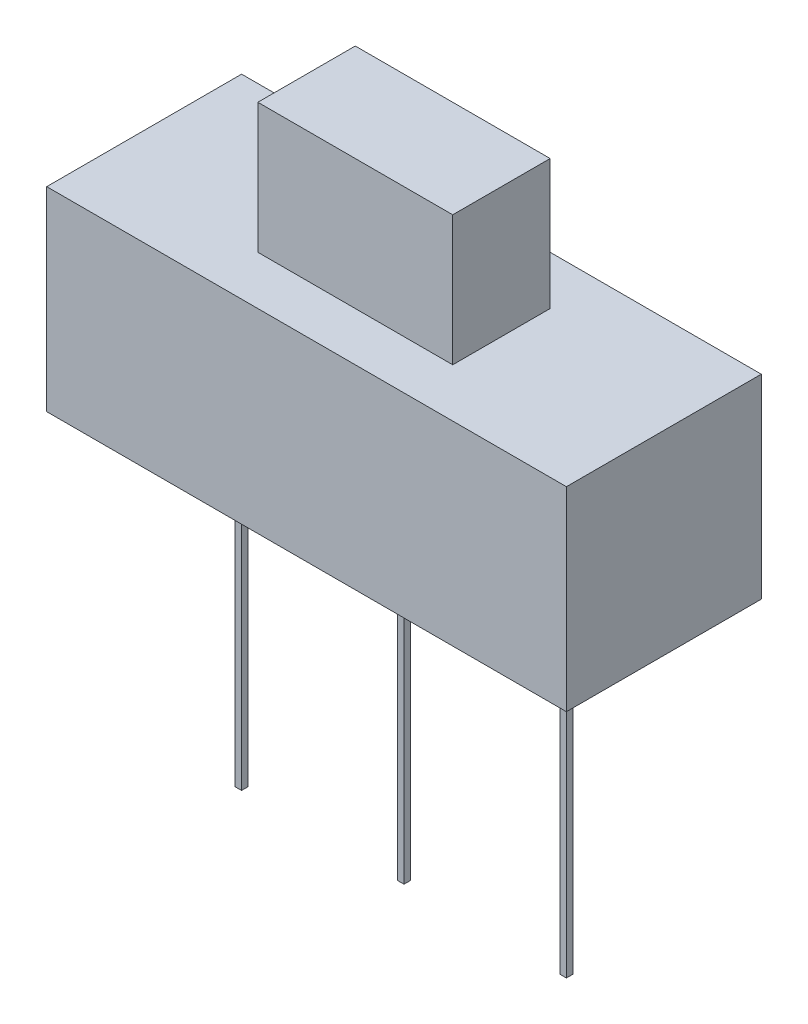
ISO-10303-21;
HEADER;
FILE_DESCRIPTION(('STEP AP214'),'2;1');
FILE_NAME('part.step','',(''),(''),'','','');
FILE_SCHEMA(('AUTOMOTIVE_DESIGN { 1 0 10303 214 1 1 1 1 }'));
ENDSEC;
DATA;
#1=APPLICATION_CONTEXT('core data for automotive mechanical design processes');
#2=APPLICATION_PROTOCOL_DEFINITION('international standard','automotive_design',2000,#1);
#3=PRODUCT_CONTEXT('',#1,'mechanical');
#4=PRODUCT('Part','Part','',(#3));
#5=PRODUCT_RELATED_PRODUCT_CATEGORY('part','',(#4));
#6=PRODUCT_DEFINITION_FORMATION('','',#4);
#7=PRODUCT_DEFINITION_CONTEXT('part definition',#1,'design');
#8=PRODUCT_DEFINITION('design','',#6,#7);
#9=PRODUCT_DEFINITION_SHAPE('','',#8);
#10=(LENGTH_UNIT() NAMED_UNIT(*) SI_UNIT(.MILLI.,.METRE.));
#11=(NAMED_UNIT(*) PLANE_ANGLE_UNIT() SI_UNIT($,.RADIAN.));
#12=(NAMED_UNIT(*) SI_UNIT($,.STERADIAN.) SOLID_ANGLE_UNIT());
#13=UNCERTAINTY_MEASURE_WITH_UNIT(LENGTH_MEASURE(1.E-05),#10,'distance_accuracy_value','');
#14=(GEOMETRIC_REPRESENTATION_CONTEXT(3) GLOBAL_UNCERTAINTY_ASSIGNED_CONTEXT((#13)) GLOBAL_UNIT_ASSIGNED_CONTEXT((#10,
#11,#12)) REPRESENTATION_CONTEXT('',''));
#15=CARTESIAN_POINT('',(0.,0.,0.));
#16=DIRECTION('',(0.,0.,1.));
#17=DIRECTION('',(1.,0.,0.));
#18=AXIS2_PLACEMENT_3D('',#15,#16,#17);
#19=CARTESIAN_POINT('',(0.,0.,0.));
#20=DIRECTION('',(0.,-1.,0.));
#21=DIRECTION('',(0.,0.,-1.));
#22=AXIS2_PLACEMENT_3D('',#19,#20,#21);
#23=PLANE('',#22);
#24=DIRECTION('',(1.,0.,0.));
#25=VECTOR('',#24,1.);
#26=CARTESIAN_POINT('',(0.,0.,0.0499999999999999));
#27=LINE('',#26,#25);
#28=CARTESIAN_POINT('',(-2.55,0.,0.0499999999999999));
#29=VERTEX_POINT('',#28);
#30=CARTESIAN_POINT('',(-2.45,0.,0.0499999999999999));
#31=VERTEX_POINT('',#30);
#32=EDGE_CURVE('E178',#29,#31,#27,.T.);
#33=ORIENTED_EDGE('',*,*,#32,.T.);
#34=DIRECTION('',(0.,0.,1.));
#35=VECTOR('',#34,1.);
#36=CARTESIAN_POINT('',(-2.45,0.,0.));
#37=LINE('',#36,#35);
#38=CARTESIAN_POINT('',(-2.45,0.,-0.0500000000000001));
#39=VERTEX_POINT('',#38);
#40=EDGE_CURVE('E192',#39,#31,#37,.T.);
#41=ORIENTED_EDGE('',*,*,#40,.F.);
#42=DIRECTION('',(1.,0.,0.));
#43=VECTOR('',#42,1.);
#44=CARTESIAN_POINT('',(0.,0.,-0.0500000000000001));
#45=LINE('',#44,#43);
#46=CARTESIAN_POINT('',(-2.55,0.,-0.0500000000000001));
#47=VERTEX_POINT('',#46);
#48=EDGE_CURVE('E205',#47,#39,#45,.T.);
#49=ORIENTED_EDGE('',*,*,#48,.F.);
#50=DIRECTION('',(0.,0.,1.));
#51=VECTOR('',#50,1.);
#52=CARTESIAN_POINT('',(-2.55,0.,0.));
#53=LINE('',#52,#51);
#54=EDGE_CURVE('E203',#47,#29,#53,.T.);
#55=ORIENTED_EDGE('',*,*,#54,.T.);
#56=EDGE_LOOP('',(#33,#41,#49,#55));
#57=FACE_BOUND('',#56,.T.);
#58=DIRECTION('',(1.,0.,0.));
#59=VECTOR('',#58,1.);
#60=CARTESIAN_POINT('',(0.,0.,0.0499999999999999));
#61=LINE('',#60,#59);
#62=CARTESIAN_POINT('',(2.45,0.,0.0499999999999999));
#63=VERTEX_POINT('',#62);
#64=CARTESIAN_POINT('',(2.55,0.,0.0499999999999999));
#65=VERTEX_POINT('',#64);
#66=EDGE_CURVE('E240',#63,#65,#61,.T.);
#67=ORIENTED_EDGE('',*,*,#66,.T.);
#68=DIRECTION('',(0.,0.,1.));
#69=VECTOR('',#68,1.);
#70=CARTESIAN_POINT('',(2.55,0.,0.));
#71=LINE('',#70,#69);
#72=CARTESIAN_POINT('',(2.55,0.,-0.0500000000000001));
#73=VERTEX_POINT('',#72);
#74=EDGE_CURVE('E245',#73,#65,#71,.T.);
#75=ORIENTED_EDGE('',*,*,#74,.F.);
#76=DIRECTION('',(1.,0.,0.));
#77=VECTOR('',#76,1.);
#78=CARTESIAN_POINT('',(0.,0.,-0.0500000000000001));
#79=LINE('',#78,#77);
#80=CARTESIAN_POINT('',(2.45,0.,-0.0500000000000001));
#81=VERTEX_POINT('',#80);
#82=EDGE_CURVE('E258',#81,#73,#79,.T.);
#83=ORIENTED_EDGE('',*,*,#82,.F.);
#84=DIRECTION('',(0.,0.,1.));
#85=VECTOR('',#84,1.);
#86=CARTESIAN_POINT('',(2.45,0.,0.));
#87=LINE('',#86,#85);
#88=EDGE_CURVE('E255',#81,#63,#87,.T.);
#89=ORIENTED_EDGE('',*,*,#88,.T.);
#90=EDGE_LOOP('',(#67,#75,#83,#89));
#91=FACE_BOUND('',#90,.T.);
#92=DIRECTION('',(0.,0.,-1.));
#93=VECTOR('',#92,1.);
#94=CARTESIAN_POINT('',(4.,0.,1.5));
#95=LINE('',#94,#93);
#96=CARTESIAN_POINT('',(4.,0.,1.5));
#97=VERTEX_POINT('',#96);
#98=CARTESIAN_POINT('',(4.,0.,-1.5));
#99=VERTEX_POINT('',#98);
#100=EDGE_CURVE('E303',#97,#99,#95,.T.);
#101=ORIENTED_EDGE('',*,*,#100,.F.);
#102=DIRECTION('',(1.,0.,0.));
#103=VECTOR('',#102,1.);
#104=CARTESIAN_POINT('',(-4.,0.,1.5));
#105=LINE('',#104,#103);
#106=CARTESIAN_POINT('',(-4.,0.,1.5));
#107=VERTEX_POINT('',#106);
#108=EDGE_CURVE('E308',#107,#97,#105,.T.);
#109=ORIENTED_EDGE('',*,*,#108,.F.);
#110=DIRECTION('',(0.,0.,1.));
#111=VECTOR('',#110,1.);
#112=CARTESIAN_POINT('',(-4.,0.,1.5));
#113=LINE('',#112,#111);
#114=CARTESIAN_POINT('',(-4.,0.,-1.5));
#115=VERTEX_POINT('',#114);
#116=EDGE_CURVE('E319',#115,#107,#113,.T.);
#117=ORIENTED_EDGE('',*,*,#116,.F.);
#118=DIRECTION('',(-1.,0.,0.));
#119=VECTOR('',#118,1.);
#120=CARTESIAN_POINT('',(-4.,0.,-1.5));
#121=LINE('',#120,#119);
#122=EDGE_CURVE('E317',#99,#115,#121,.T.);
#123=ORIENTED_EDGE('',*,*,#122,.F.);
#124=EDGE_LOOP('',(#101,#109,#117,#123));
#125=FACE_BOUND('',#124,.T.);
#126=DIRECTION('',(0.,0.,1.));
#127=VECTOR('',#126,1.);
#128=CARTESIAN_POINT('',(0.05,0.,0.));
#129=LINE('',#128,#127);
#130=CARTESIAN_POINT('',(0.05,0.,-0.0500000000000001));
#131=VERTEX_POINT('',#130);
#132=CARTESIAN_POINT('',(0.05,0.,0.0499999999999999));
#133=VERTEX_POINT('',#132);
#134=EDGE_CURVE('E57',#131,#133,#129,.T.);
#135=ORIENTED_EDGE('',*,*,#134,.F.);
#136=DIRECTION('',(1.,0.,0.));
#137=VECTOR('',#136,1.);
#138=CARTESIAN_POINT('',(0.,0.,-0.0500000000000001));
#139=LINE('',#138,#137);
#140=CARTESIAN_POINT('',(-0.05,0.,-0.0500000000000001));
#141=VERTEX_POINT('',#140);
#142=EDGE_CURVE('E183',#141,#131,#139,.T.);
#143=ORIENTED_EDGE('',*,*,#142,.F.);
#144=DIRECTION('',(0.,0.,1.));
#145=VECTOR('',#144,1.);
#146=CARTESIAN_POINT('',(-0.05,0.,0.));
#147=LINE('',#146,#145);
#148=CARTESIAN_POINT('',(-0.05,0.,0.0499999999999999));
#149=VERTEX_POINT('',#148);
#150=EDGE_CURVE('E215',#141,#149,#147,.T.);
#151=ORIENTED_EDGE('',*,*,#150,.T.);
#152=DIRECTION('',(1.,0.,0.));
#153=VECTOR('',#152,1.);
#154=CARTESIAN_POINT('',(0.,0.,0.0499999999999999));
#155=LINE('',#154,#153);
#156=EDGE_CURVE('E227',#149,#133,#155,.T.);
#157=ORIENTED_EDGE('',*,*,#156,.T.);
#158=EDGE_LOOP('',(#135,#143,#151,#157));
#159=FACE_BOUND('',#158,.T.);
#160=ADVANCED_FACE('F34',(#57,#91,#125,#159),#23,.T.);
#161=CARTESIAN_POINT('',(0.,3.,0.));
#162=DIRECTION('',(0.,-1.,0.));
#163=DIRECTION('',(0.,0.,-1.));
#164=AXIS2_PLACEMENT_3D('',#161,#162,#163);
#165=PLANE('',#164);
#166=DIRECTION('',(0.,0.,-1.));
#167=VECTOR('',#166,1.);
#168=CARTESIAN_POINT('',(4.,3.,1.5));
#169=LINE('',#168,#167);
#170=CARTESIAN_POINT('',(4.,3.,1.5));
#171=VERTEX_POINT('',#170);
#172=CARTESIAN_POINT('',(4.,3.,-1.5));
#173=VERTEX_POINT('',#172);
#174=EDGE_CURVE('E304',#171,#173,#169,.T.);
#175=ORIENTED_EDGE('',*,*,#174,.T.);
#176=DIRECTION('',(-1.,0.,0.));
#177=VECTOR('',#176,1.);
#178=CARTESIAN_POINT('',(-4.,3.,-1.5));
#179=LINE('',#178,#177);
#180=CARTESIAN_POINT('',(-4.,3.,-1.5));
#181=VERTEX_POINT('',#180);
#182=EDGE_CURVE('E307',#173,#181,#179,.T.);
#183=ORIENTED_EDGE('',*,*,#182,.T.);
#184=DIRECTION('',(0.,0.,1.));
#185=VECTOR('',#184,1.);
#186=CARTESIAN_POINT('',(-4.,3.,1.5));
#187=LINE('',#186,#185);
#188=CARTESIAN_POINT('',(-4.,3.,1.5));
#189=VERTEX_POINT('',#188);
#190=EDGE_CURVE('E310',#181,#189,#187,.T.);
#191=ORIENTED_EDGE('',*,*,#190,.T.);
#192=DIRECTION('',(1.,0.,0.));
#193=VECTOR('',#192,1.);
#194=CARTESIAN_POINT('',(-4.,3.,1.5));
#195=LINE('',#194,#193);
#196=EDGE_CURVE('E312',#189,#171,#195,.T.);
#197=ORIENTED_EDGE('',*,*,#196,.T.);
#198=EDGE_LOOP('',(#175,#183,#191,#197));
#199=FACE_BOUND('',#198,.T.);
#200=DIRECTION('',(0.,0.,-1.));
#201=VECTOR('',#200,1.);
#202=CARTESIAN_POINT('',(1.5,3.,0.75));
#203=LINE('',#202,#201);
#204=CARTESIAN_POINT('',(1.5,3.,0.75));
#205=VERTEX_POINT('',#204);
#206=CARTESIAN_POINT('',(1.5,3.,-0.75));
#207=VERTEX_POINT('',#206);
#208=EDGE_CURVE('E270',#205,#207,#203,.T.);
#209=ORIENTED_EDGE('',*,*,#208,.F.);
#210=DIRECTION('',(1.,0.,0.));
#211=VECTOR('',#210,1.);
#212=CARTESIAN_POINT('',(-1.5,3.,0.75));
#213=LINE('',#212,#211);
#214=CARTESIAN_POINT('',(-1.5,3.,0.75));
#215=VERTEX_POINT('',#214);
#216=EDGE_CURVE('E275',#215,#205,#213,.T.);
#217=ORIENTED_EDGE('',*,*,#216,.F.);
#218=DIRECTION('',(0.,0.,1.));
#219=VECTOR('',#218,1.);
#220=CARTESIAN_POINT('',(-1.5,3.,0.75));
#221=LINE('',#220,#219);
#222=CARTESIAN_POINT('',(-1.5,3.,-0.75));
#223=VERTEX_POINT('',#222);
#224=EDGE_CURVE('E287',#223,#215,#221,.T.);
#225=ORIENTED_EDGE('',*,*,#224,.F.);
#226=DIRECTION('',(-1.,0.,0.));
#227=VECTOR('',#226,1.);
#228=CARTESIAN_POINT('',(-1.5,3.,-0.75));
#229=LINE('',#228,#227);
#230=EDGE_CURVE('E284',#207,#223,#229,.T.);
#231=ORIENTED_EDGE('',*,*,#230,.F.);
#232=EDGE_LOOP('',(#209,#217,#225,#231));
#233=FACE_BOUND('',#232,.T.);
#234=ADVANCED_FACE('F345',(#199,#233),#165,.F.);
#235=CARTESIAN_POINT('',(4.,3.,1.5));
#236=DIRECTION('',(-1.,0.,0.));
#237=DIRECTION('',(0.,0.,1.));
#238=AXIS2_PLACEMENT_3D('',#235,#236,#237);
#239=PLANE('',#238);
#240=ORIENTED_EDGE('',*,*,#100,.T.);
#241=DIRECTION('',(0.,-1.,0.));
#242=VECTOR('',#241,1.);
#243=CARTESIAN_POINT('',(4.,3.,-1.5));
#244=LINE('',#243,#242);
#245=EDGE_CURVE('E11',#173,#99,#244,.T.);
#246=ORIENTED_EDGE('',*,*,#245,.F.);
#247=ORIENTED_EDGE('',*,*,#174,.F.);
#248=DIRECTION('',(0.,-1.,0.));
#249=VECTOR('',#248,1.);
#250=CARTESIAN_POINT('',(4.,3.,1.5));
#251=LINE('',#250,#249);
#252=EDGE_CURVE('E314',#171,#97,#251,.T.);
#253=ORIENTED_EDGE('',*,*,#252,.T.);
#254=EDGE_LOOP('',(#240,#246,#247,#253));
#255=FACE_BOUND('',#254,.T.);
#256=ADVANCED_FACE('F36',(#255),#239,.F.);
#257=CARTESIAN_POINT('',(-4.,3.,-1.5));
#258=DIRECTION('',(0.,0.,1.));
#259=DIRECTION('',(1.,0.,0.));
#260=AXIS2_PLACEMENT_3D('',#257,#258,#259);
#261=PLANE('',#260);
#262=ORIENTED_EDGE('',*,*,#122,.T.);
#263=DIRECTION('',(0.,-1.,0.));
#264=VECTOR('',#263,1.);
#265=CARTESIAN_POINT('',(-4.,3.,-1.5));
#266=LINE('',#265,#264);
#267=EDGE_CURVE('E42',#181,#115,#266,.T.);
#268=ORIENTED_EDGE('',*,*,#267,.F.);
#269=ORIENTED_EDGE('',*,*,#182,.F.);
#270=ORIENTED_EDGE('',*,*,#245,.T.);
#271=EDGE_LOOP('',(#262,#268,#269,#270));
#272=FACE_BOUND('',#271,.T.);
#273=ADVANCED_FACE('F347',(#272),#261,.F.);
#274=CARTESIAN_POINT('',(-4.,3.,1.5));
#275=DIRECTION('',(1.,0.,0.));
#276=DIRECTION('',(0.,0.,-1.));
#277=AXIS2_PLACEMENT_3D('',#274,#275,#276);
#278=PLANE('',#277);
#279=ORIENTED_EDGE('',*,*,#116,.T.);
#280=DIRECTION('',(0.,-1.,0.));
#281=VECTOR('',#280,1.);
#282=CARTESIAN_POINT('',(-4.,3.,1.5));
#283=LINE('',#282,#281);
#284=EDGE_CURVE('E324',#189,#107,#283,.T.);
#285=ORIENTED_EDGE('',*,*,#284,.F.);
#286=ORIENTED_EDGE('',*,*,#190,.F.);
#287=ORIENTED_EDGE('',*,*,#267,.T.);
#288=EDGE_LOOP('',(#279,#285,#286,#287));
#289=FACE_BOUND('',#288,.T.);
#290=ADVANCED_FACE('F331',(#289),#278,.F.);
#291=CARTESIAN_POINT('',(-4.,3.,1.5));
#292=DIRECTION('',(0.,0.,-1.));
#293=DIRECTION('',(-1.,0.,0.));
#294=AXIS2_PLACEMENT_3D('',#291,#292,#293);
#295=PLANE('',#294);
#296=ORIENTED_EDGE('',*,*,#108,.T.);
#297=ORIENTED_EDGE('',*,*,#252,.F.);
#298=ORIENTED_EDGE('',*,*,#196,.F.);
#299=ORIENTED_EDGE('',*,*,#284,.T.);
#300=EDGE_LOOP('',(#296,#297,#298,#299));
#301=FACE_BOUND('',#300,.T.);
#302=ADVANCED_FACE('F339',(#301),#295,.F.);
#303=CARTESIAN_POINT('',(1.5,5.,0.75));
#304=DIRECTION('',(-1.,0.,0.));
#305=DIRECTION('',(0.,0.,1.));
#306=AXIS2_PLACEMENT_3D('',#303,#304,#305);
#307=PLANE('',#306);
#308=ORIENTED_EDGE('',*,*,#208,.T.);
#309=DIRECTION('',(0.,-1.,0.));
#310=VECTOR('',#309,1.);
#311=CARTESIAN_POINT('',(1.5,5.,-0.75));
#312=LINE('',#311,#310);
#313=CARTESIAN_POINT('',(1.5,5.,-0.75));
#314=VERTEX_POINT('',#313);
#315=EDGE_CURVE('E300',#314,#207,#312,.T.);
#316=ORIENTED_EDGE('',*,*,#315,.F.);
#317=DIRECTION('',(0.,0.,-1.));
#318=VECTOR('',#317,1.);
#319=CARTESIAN_POINT('',(1.5,5.,0.75));
#320=LINE('',#319,#318);
#321=CARTESIAN_POINT('',(1.5,5.,0.75));
#322=VERTEX_POINT('',#321);
#323=EDGE_CURVE('E271',#322,#314,#320,.T.);
#324=ORIENTED_EDGE('',*,*,#323,.F.);
#325=DIRECTION('',(0.,-1.,0.));
#326=VECTOR('',#325,1.);
#327=CARTESIAN_POINT('',(1.5,5.,0.75));
#328=LINE('',#327,#326);
#329=EDGE_CURVE('E281',#322,#205,#328,.T.);
#330=ORIENTED_EDGE('',*,*,#329,.T.);
#331=EDGE_LOOP('',(#308,#316,#324,#330));
#332=FACE_BOUND('',#331,.T.);
#333=ADVANCED_FACE('F365',(#332),#307,.F.);
#334=CARTESIAN_POINT('',(-1.5,5.,-0.75));
#335=DIRECTION('',(0.,0.,1.));
#336=DIRECTION('',(1.,0.,0.));
#337=AXIS2_PLACEMENT_3D('',#334,#335,#336);
#338=PLANE('',#337);
#339=ORIENTED_EDGE('',*,*,#230,.T.);
#340=DIRECTION('',(0.,-1.,0.));
#341=VECTOR('',#340,1.);
#342=CARTESIAN_POINT('',(-1.5,5.,-0.75));
#343=LINE('',#342,#341);
#344=CARTESIAN_POINT('',(-1.5,5.,-0.75));
#345=VERTEX_POINT('',#344);
#346=EDGE_CURVE('E297',#345,#223,#343,.T.);
#347=ORIENTED_EDGE('',*,*,#346,.F.);
#348=DIRECTION('',(-1.,0.,0.));
#349=VECTOR('',#348,1.);
#350=CARTESIAN_POINT('',(-1.5,5.,-0.75));
#351=LINE('',#350,#349);
#352=EDGE_CURVE('E274',#314,#345,#351,.T.);
#353=ORIENTED_EDGE('',*,*,#352,.F.);
#354=ORIENTED_EDGE('',*,*,#315,.T.);
#355=EDGE_LOOP('',(#339,#347,#353,#354));
#356=FACE_BOUND('',#355,.T.);
#357=ADVANCED_FACE('F369',(#356),#338,.F.);
#358=CARTESIAN_POINT('',(-1.5,5.,0.75));
#359=DIRECTION('',(1.,0.,0.));
#360=DIRECTION('',(0.,0.,-1.));
#361=AXIS2_PLACEMENT_3D('',#358,#359,#360);
#362=PLANE('',#361);
#363=ORIENTED_EDGE('',*,*,#224,.T.);
#364=DIRECTION('',(0.,-1.,0.));
#365=VECTOR('',#364,1.);
#366=CARTESIAN_POINT('',(-1.5,5.,0.75));
#367=LINE('',#366,#365);
#368=CARTESIAN_POINT('',(-1.5,5.,0.75));
#369=VERTEX_POINT('',#368);
#370=EDGE_CURVE('E294',#369,#215,#367,.T.);
#371=ORIENTED_EDGE('',*,*,#370,.F.);
#372=DIRECTION('',(0.,0.,1.));
#373=VECTOR('',#372,1.);
#374=CARTESIAN_POINT('',(-1.5,5.,0.75));
#375=LINE('',#374,#373);
#376=EDGE_CURVE('E277',#345,#369,#375,.T.);
#377=ORIENTED_EDGE('',*,*,#376,.F.);
#378=ORIENTED_EDGE('',*,*,#346,.T.);
#379=EDGE_LOOP('',(#363,#371,#377,#378));
#380=FACE_BOUND('',#379,.T.);
#381=ADVANCED_FACE('F374',(#380),#362,.F.);
#382=CARTESIAN_POINT('',(-1.5,5.,0.75));
#383=DIRECTION('',(0.,0.,-1.));
#384=DIRECTION('',(-1.,0.,0.));
#385=AXIS2_PLACEMENT_3D('',#382,#383,#384);
#386=PLANE('',#385);
#387=ORIENTED_EDGE('',*,*,#216,.T.);
#388=ORIENTED_EDGE('',*,*,#329,.F.);
#389=DIRECTION('',(1.,0.,0.));
#390=VECTOR('',#389,1.);
#391=CARTESIAN_POINT('',(-1.5,5.,0.75));
#392=LINE('',#391,#390);
#393=EDGE_CURVE('E279',#369,#322,#392,.T.);
#394=ORIENTED_EDGE('',*,*,#393,.F.);
#395=ORIENTED_EDGE('',*,*,#370,.T.);
#396=EDGE_LOOP('',(#387,#388,#394,#395));
#397=FACE_BOUND('',#396,.T.);
#398=ADVANCED_FACE('F380',(#397),#386,.F.);
#399=CARTESIAN_POINT('',(0.,5.,0.));
#400=DIRECTION('',(0.,-1.,0.));
#401=DIRECTION('',(0.,0.,-1.));
#402=AXIS2_PLACEMENT_3D('',#399,#400,#401);
#403=PLANE('',#402);
#404=ORIENTED_EDGE('',*,*,#323,.T.);
#405=ORIENTED_EDGE('',*,*,#352,.T.);
#406=ORIENTED_EDGE('',*,*,#376,.T.);
#407=ORIENTED_EDGE('',*,*,#393,.T.);
#408=EDGE_LOOP('',(#404,#405,#406,#407));
#409=FACE_BOUND('',#408,.T.);
#410=ADVANCED_FACE('F384',(#409),#403,.F.);
#411=CARTESIAN_POINT('',(0.,-5.,0.0499999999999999));
#412=DIRECTION('',(0.,0.,1.));
#413=DIRECTION('',(1.,0.,0.));
#414=AXIS2_PLACEMENT_3D('',#411,#412,#413);
#415=PLANE('',#414);
#416=ORIENTED_EDGE('',*,*,#66,.F.);
#417=DIRECTION('',(0.,1.,0.));
#418=VECTOR('',#417,1.);
#419=CARTESIAN_POINT('',(2.45,-5.,0.0499999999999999));
#420=LINE('',#419,#418);
#421=CARTESIAN_POINT('',(2.45,-5.,0.0499999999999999));
#422=VERTEX_POINT('',#421);
#423=EDGE_CURVE('E268',#422,#63,#420,.T.);
#424=ORIENTED_EDGE('',*,*,#423,.F.);
#425=DIRECTION('',(1.,0.,0.));
#426=VECTOR('',#425,1.);
#427=CARTESIAN_POINT('',(0.,-5.,0.0499999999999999));
#428=LINE('',#427,#426);
#429=CARTESIAN_POINT('',(2.55,-5.,0.0499999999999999));
#430=VERTEX_POINT('',#429);
#431=EDGE_CURVE('E241',#422,#430,#428,.T.);
#432=ORIENTED_EDGE('',*,*,#431,.T.);
#433=DIRECTION('',(0.,1.,0.));
#434=VECTOR('',#433,1.);
#435=CARTESIAN_POINT('',(2.55,-5.,0.0499999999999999));
#436=LINE('',#435,#434);
#437=EDGE_CURVE('E252',#430,#65,#436,.T.);
#438=ORIENTED_EDGE('',*,*,#437,.T.);
#439=EDGE_LOOP('',(#416,#424,#432,#438));
#440=FACE_BOUND('',#439,.T.);
#441=ADVANCED_FACE('F388',(#440),#415,.T.);
#442=CARTESIAN_POINT('',(2.45,-5.,0.));
#443=DIRECTION('',(-1.,0.,0.));
#444=DIRECTION('',(0.,0.,1.));
#445=AXIS2_PLACEMENT_3D('',#442,#443,#444);
#446=PLANE('',#445);
#447=ORIENTED_EDGE('',*,*,#88,.F.);
#448=DIRECTION('',(0.,1.,0.));
#449=VECTOR('',#448,1.);
#450=CARTESIAN_POINT('',(2.45,-5.,-0.0500000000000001));
#451=LINE('',#450,#449);
#452=CARTESIAN_POINT('',(2.45,-5.,-0.0500000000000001));
#453=VERTEX_POINT('',#452);
#454=EDGE_CURVE('E266',#453,#81,#451,.T.);
#455=ORIENTED_EDGE('',*,*,#454,.F.);
#456=DIRECTION('',(0.,0.,1.));
#457=VECTOR('',#456,1.);
#458=CARTESIAN_POINT('',(2.45,-5.,0.));
#459=LINE('',#458,#457);
#460=EDGE_CURVE('E244',#453,#422,#459,.T.);
#461=ORIENTED_EDGE('',*,*,#460,.T.);
#462=ORIENTED_EDGE('',*,*,#423,.T.);
#463=EDGE_LOOP('',(#447,#455,#461,#462));
#464=FACE_BOUND('',#463,.T.);
#465=ADVANCED_FACE('F392',(#464),#446,.T.);
#466=CARTESIAN_POINT('',(0.,-5.,-0.0500000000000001));
#467=DIRECTION('',(0.,0.,1.));
#468=DIRECTION('',(1.,0.,0.));
#469=AXIS2_PLACEMENT_3D('',#466,#467,#468);
#470=PLANE('',#469);
#471=ORIENTED_EDGE('',*,*,#82,.T.);
#472=DIRECTION('',(0.,1.,0.));
#473=VECTOR('',#472,1.);
#474=CARTESIAN_POINT('',(2.55,-5.,-0.0500000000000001));
#475=LINE('',#474,#473);
#476=CARTESIAN_POINT('',(2.55,-5.,-0.0500000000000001));
#477=VERTEX_POINT('',#476);
#478=EDGE_CURVE('E264',#477,#73,#475,.T.);
#479=ORIENTED_EDGE('',*,*,#478,.F.);
#480=DIRECTION('',(1.,0.,0.));
#481=VECTOR('',#480,1.);
#482=CARTESIAN_POINT('',(0.,-5.,-0.0500000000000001));
#483=LINE('',#482,#481);
#484=EDGE_CURVE('E248',#453,#477,#483,.T.);
#485=ORIENTED_EDGE('',*,*,#484,.F.);
#486=ORIENTED_EDGE('',*,*,#454,.T.);
#487=EDGE_LOOP('',(#471,#479,#485,#486));
#488=FACE_BOUND('',#487,.T.);
#489=ADVANCED_FACE('F396',(#488),#470,.F.);
#490=CARTESIAN_POINT('',(2.55,-5.,0.));
#491=DIRECTION('',(-1.,0.,0.));
#492=DIRECTION('',(0.,0.,1.));
#493=AXIS2_PLACEMENT_3D('',#490,#491,#492);
#494=PLANE('',#493);
#495=ORIENTED_EDGE('',*,*,#74,.T.);
#496=ORIENTED_EDGE('',*,*,#437,.F.);
#497=DIRECTION('',(0.,0.,1.));
#498=VECTOR('',#497,1.);
#499=CARTESIAN_POINT('',(2.55,-5.,0.));
#500=LINE('',#499,#498);
#501=EDGE_CURVE('E250',#477,#430,#500,.T.);
#502=ORIENTED_EDGE('',*,*,#501,.F.);
#503=ORIENTED_EDGE('',*,*,#478,.T.);
#504=EDGE_LOOP('',(#495,#496,#502,#503));
#505=FACE_BOUND('',#504,.T.);
#506=ADVANCED_FACE('F400',(#505),#494,.F.);
#507=CARTESIAN_POINT('',(0.,-5.,0.));
#508=DIRECTION('',(0.,-1.,0.));
#509=DIRECTION('',(0.,0.,-1.));
#510=AXIS2_PLACEMENT_3D('',#507,#508,#509);
#511=PLANE('',#510);
#512=ORIENTED_EDGE('',*,*,#431,.F.);
#513=ORIENTED_EDGE('',*,*,#460,.F.);
#514=ORIENTED_EDGE('',*,*,#484,.T.);
#515=ORIENTED_EDGE('',*,*,#501,.T.);
#516=EDGE_LOOP('',(#512,#513,#514,#515));
#517=FACE_BOUND('',#516,.T.);
#518=ADVANCED_FACE('F404',(#517),#511,.T.);
#519=CARTESIAN_POINT('',(0.,-5.,-0.0500000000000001));
#520=DIRECTION('',(0.,0.,1.));
#521=DIRECTION('',(1.,0.,0.));
#522=AXIS2_PLACEMENT_3D('',#519,#520,#521);
#523=PLANE('',#522);
#524=ORIENTED_EDGE('',*,*,#142,.T.);
#525=DIRECTION('',(0.,1.,0.));
#526=VECTOR('',#525,1.);
#527=CARTESIAN_POINT('',(0.05,-5.,-0.0500000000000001));
#528=LINE('',#527,#526);
#529=CARTESIAN_POINT('',(0.05,-5.,-0.0500000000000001));
#530=VERTEX_POINT('',#529);
#531=EDGE_CURVE('E238',#530,#131,#528,.T.);
#532=ORIENTED_EDGE('',*,*,#531,.F.);
#533=DIRECTION('',(1.,0.,0.));
#534=VECTOR('',#533,1.);
#535=CARTESIAN_POINT('',(0.,-5.,-0.0500000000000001));
#536=LINE('',#535,#534);
#537=CARTESIAN_POINT('',(-0.05,-5.,-0.0500000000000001));
#538=VERTEX_POINT('',#537);
#539=EDGE_CURVE('E211',#538,#530,#536,.T.);
#540=ORIENTED_EDGE('',*,*,#539,.F.);
#541=DIRECTION('',(0.,1.,0.));
#542=VECTOR('',#541,1.);
#543=CARTESIAN_POINT('',(-0.05,-5.,-0.0500000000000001));
#544=LINE('',#543,#542);
#545=EDGE_CURVE('E223',#538,#141,#544,.T.);
#546=ORIENTED_EDGE('',*,*,#545,.T.);
#547=EDGE_LOOP('',(#524,#532,#540,#546));
#548=FACE_BOUND('',#547,.T.);
#549=ADVANCED_FACE('F408',(#548),#523,.F.);
#550=CARTESIAN_POINT('',(0.05,-5.,0.));
#551=DIRECTION('',(-1.,0.,0.));
#552=DIRECTION('',(0.,0.,1.));
#553=AXIS2_PLACEMENT_3D('',#550,#551,#552);
#554=PLANE('',#553);
#555=ORIENTED_EDGE('',*,*,#134,.T.);
#556=DIRECTION('',(0.,1.,0.));
#557=VECTOR('',#556,1.);
#558=CARTESIAN_POINT('',(0.05,-5.,0.0499999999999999));
#559=LINE('',#558,#557);
#560=CARTESIAN_POINT('',(0.05,-5.,0.0499999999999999));
#561=VERTEX_POINT('',#560);
#562=EDGE_CURVE('E235',#561,#133,#559,.T.);
#563=ORIENTED_EDGE('',*,*,#562,.F.);
#564=DIRECTION('',(0.,0.,1.));
#565=VECTOR('',#564,1.);
#566=CARTESIAN_POINT('',(0.05,-5.,0.));
#567=LINE('',#566,#565);
#568=EDGE_CURVE('E214',#530,#561,#567,.T.);
#569=ORIENTED_EDGE('',*,*,#568,.F.);
#570=ORIENTED_EDGE('',*,*,#531,.T.);
#571=EDGE_LOOP('',(#555,#563,#569,#570));
#572=FACE_BOUND('',#571,.T.);
#573=ADVANCED_FACE('F412',(#572),#554,.F.);
#574=CARTESIAN_POINT('',(0.,-5.,0.0499999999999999));
#575=DIRECTION('',(0.,0.,1.));
#576=DIRECTION('',(1.,0.,0.));
#577=AXIS2_PLACEMENT_3D('',#574,#575,#576);
#578=PLANE('',#577);
#579=ORIENTED_EDGE('',*,*,#156,.F.);
#580=DIRECTION('',(0.,1.,0.));
#581=VECTOR('',#580,1.);
#582=CARTESIAN_POINT('',(-0.05,-5.,0.0499999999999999));
#583=LINE('',#582,#581);
#584=CARTESIAN_POINT('',(-0.05,-5.,0.0499999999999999));
#585=VERTEX_POINT('',#584);
#586=EDGE_CURVE('E232',#585,#149,#583,.T.);
#587=ORIENTED_EDGE('',*,*,#586,.F.);
#588=DIRECTION('',(1.,0.,0.));
#589=VECTOR('',#588,1.);
#590=CARTESIAN_POINT('',(0.,-5.,0.0499999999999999));
#591=LINE('',#590,#589);
#592=EDGE_CURVE('E217',#585,#561,#591,.T.);
#593=ORIENTED_EDGE('',*,*,#592,.T.);
#594=ORIENTED_EDGE('',*,*,#562,.T.);
#595=EDGE_LOOP('',(#579,#587,#593,#594));
#596=FACE_BOUND('',#595,.T.);
#597=ADVANCED_FACE('F416',(#596),#578,.T.);
#598=CARTESIAN_POINT('',(-0.05,-5.,0.));
#599=DIRECTION('',(-1.,0.,0.));
#600=DIRECTION('',(0.,0.,1.));
#601=AXIS2_PLACEMENT_3D('',#598,#599,#600);
#602=PLANE('',#601);
#603=ORIENTED_EDGE('',*,*,#150,.F.);
#604=ORIENTED_EDGE('',*,*,#545,.F.);
#605=DIRECTION('',(0.,0.,1.));
#606=VECTOR('',#605,1.);
#607=CARTESIAN_POINT('',(-0.05,-5.,0.));
#608=LINE('',#607,#606);
#609=EDGE_CURVE('E220',#538,#585,#608,.T.);
#610=ORIENTED_EDGE('',*,*,#609,.T.);
#611=ORIENTED_EDGE('',*,*,#586,.T.);
#612=EDGE_LOOP('',(#603,#604,#610,#611));
#613=FACE_BOUND('',#612,.T.);
#614=ADVANCED_FACE('F420',(#613),#602,.T.);
#615=CARTESIAN_POINT('',(0.,-5.,0.));
#616=DIRECTION('',(0.,-1.,0.));
#617=DIRECTION('',(0.,0.,-1.));
#618=AXIS2_PLACEMENT_3D('',#615,#616,#617);
#619=PLANE('',#618);
#620=ORIENTED_EDGE('',*,*,#539,.T.);
#621=ORIENTED_EDGE('',*,*,#568,.T.);
#622=ORIENTED_EDGE('',*,*,#592,.F.);
#623=ORIENTED_EDGE('',*,*,#609,.F.);
#624=EDGE_LOOP('',(#620,#621,#622,#623));
#625=FACE_BOUND('',#624,.T.);
#626=ADVANCED_FACE('F424',(#625),#619,.T.);
#627=CARTESIAN_POINT('',(0.,-5.,0.0499999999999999));
#628=DIRECTION('',(0.,0.,1.));
#629=DIRECTION('',(1.,0.,0.));
#630=AXIS2_PLACEMENT_3D('',#627,#628,#629);
#631=PLANE('',#630);
#632=ORIENTED_EDGE('',*,*,#32,.F.);
#633=DIRECTION('',(0.,1.,0.));
#634=VECTOR('',#633,1.);
#635=CARTESIAN_POINT('',(-2.55,-5.,0.0499999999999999));
#636=LINE('',#635,#634);
#637=CARTESIAN_POINT('',(-2.55,-5.,0.0499999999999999));
#638=VERTEX_POINT('',#637);
#639=EDGE_CURVE('E173',#638,#29,#636,.T.);
#640=ORIENTED_EDGE('',*,*,#639,.F.);
#641=DIRECTION('',(1.,0.,0.));
#642=VECTOR('',#641,1.);
#643=CARTESIAN_POINT('',(0.,-5.,0.0499999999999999));
#644=LINE('',#643,#642);
#645=CARTESIAN_POINT('',(-2.45,-5.,0.0499999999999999));
#646=VERTEX_POINT('',#645);
#647=EDGE_CURVE('E176',#638,#646,#644,.T.);
#648=ORIENTED_EDGE('',*,*,#647,.T.);
#649=DIRECTION('',(0.,1.,0.));
#650=VECTOR('',#649,1.);
#651=CARTESIAN_POINT('',(-2.45,-5.,0.0499999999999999));
#652=LINE('',#651,#650);
#653=EDGE_CURVE('E201',#646,#31,#652,.T.);
#654=ORIENTED_EDGE('',*,*,#653,.T.);
#655=EDGE_LOOP('',(#632,#640,#648,#654));
#656=FACE_BOUND('',#655,.T.);
#657=ADVANCED_FACE('F175',(#656),#631,.T.);
#658=CARTESIAN_POINT('',(-2.55,-5.,0.));
#659=DIRECTION('',(-1.,0.,0.));
#660=DIRECTION('',(0.,0.,1.));
#661=AXIS2_PLACEMENT_3D('',#658,#659,#660);
#662=PLANE('',#661);
#663=ORIENTED_EDGE('',*,*,#54,.F.);
#664=DIRECTION('',(0.,1.,0.));
#665=VECTOR('',#664,1.);
#666=CARTESIAN_POINT('',(-2.55,-5.,-0.0500000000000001));
#667=LINE('',#666,#665);
#668=CARTESIAN_POINT('',(-2.55,-5.,-0.0500000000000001));
#669=VERTEX_POINT('',#668);
#670=EDGE_CURVE('E184',#669,#47,#667,.T.);
#671=ORIENTED_EDGE('',*,*,#670,.F.);
#672=DIRECTION('',(0.,0.,1.));
#673=VECTOR('',#672,1.);
#674=CARTESIAN_POINT('',(-2.55,-5.,0.));
#675=LINE('',#674,#673);
#676=EDGE_CURVE('E189',#669,#638,#675,.T.);
#677=ORIENTED_EDGE('',*,*,#676,.T.);
#678=ORIENTED_EDGE('',*,*,#639,.T.);
#679=EDGE_LOOP('',(#663,#671,#677,#678));
#680=FACE_BOUND('',#679,.T.);
#681=ADVANCED_FACE('F194',(#680),#662,.T.);
#682=CARTESIAN_POINT('',(0.,-5.,-0.0500000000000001));
#683=DIRECTION('',(0.,0.,1.));
#684=DIRECTION('',(1.,0.,0.));
#685=AXIS2_PLACEMENT_3D('',#682,#683,#684);
#686=PLANE('',#685);
#687=ORIENTED_EDGE('',*,*,#48,.T.);
#688=DIRECTION('',(0.,1.,0.));
#689=VECTOR('',#688,1.);
#690=CARTESIAN_POINT('',(-2.45,-5.,-0.0500000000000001));
#691=LINE('',#690,#689);
#692=CARTESIAN_POINT('',(-2.45,-5.,-0.0500000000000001));
#693=VERTEX_POINT('',#692);
#694=EDGE_CURVE('E49',#693,#39,#691,.T.);
#695=ORIENTED_EDGE('',*,*,#694,.F.);
#696=DIRECTION('',(1.,0.,0.));
#697=VECTOR('',#696,1.);
#698=CARTESIAN_POINT('',(0.,-5.,-0.0500000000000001));
#699=LINE('',#698,#697);
#700=EDGE_CURVE('E196',#669,#693,#699,.T.);
#701=ORIENTED_EDGE('',*,*,#700,.F.);
#702=ORIENTED_EDGE('',*,*,#670,.T.);
#703=EDGE_LOOP('',(#687,#695,#701,#702));
#704=FACE_BOUND('',#703,.T.);
#705=ADVANCED_FACE('F433',(#704),#686,.F.);
#706=CARTESIAN_POINT('',(-2.45,-5.,0.));
#707=DIRECTION('',(-1.,0.,0.));
#708=DIRECTION('',(0.,0.,1.));
#709=AXIS2_PLACEMENT_3D('',#706,#707,#708);
#710=PLANE('',#709);
#711=ORIENTED_EDGE('',*,*,#40,.T.);
#712=ORIENTED_EDGE('',*,*,#653,.F.);
#713=DIRECTION('',(0.,0.,1.));
#714=VECTOR('',#713,1.);
#715=CARTESIAN_POINT('',(-2.45,-5.,0.));
#716=LINE('',#715,#714);
#717=EDGE_CURVE('E190',#693,#646,#716,.T.);
#718=ORIENTED_EDGE('',*,*,#717,.F.);
#719=ORIENTED_EDGE('',*,*,#694,.T.);
#720=EDGE_LOOP('',(#711,#712,#718,#719));
#721=FACE_BOUND('',#720,.T.);
#722=ADVANCED_FACE('F436',(#721),#710,.F.);
#723=CARTESIAN_POINT('',(0.,-5.,0.));
#724=DIRECTION('',(0.,-1.,0.));
#725=DIRECTION('',(0.,0.,-1.));
#726=AXIS2_PLACEMENT_3D('',#723,#724,#725);
#727=PLANE('',#726);
#728=ORIENTED_EDGE('',*,*,#647,.F.);
#729=ORIENTED_EDGE('',*,*,#676,.F.);
#730=ORIENTED_EDGE('',*,*,#700,.T.);
#731=ORIENTED_EDGE('',*,*,#717,.T.);
#732=EDGE_LOOP('',(#728,#729,#730,#731));
#733=FACE_BOUND('',#732,.T.);
#734=ADVANCED_FACE('F188',(#733),#727,.T.);
#735=CLOSED_SHELL('',(#160,#234,#256,#273,#290,#302,#333,#357,#381,#398,#410,#441,#465,#489,
#506,#518,#549,#573,#597,#614,#626,#657,#681,#705,#722,#734));
#736=MANIFOLD_SOLID_BREP('B2',#735);
#737=ADVANCED_BREP_SHAPE_REPRESENTATION('',(#18,#736),#14);
#738=SHAPE_DEFINITION_REPRESENTATION(#9,#737);
ENDSEC;
END-ISO-10303-21;
